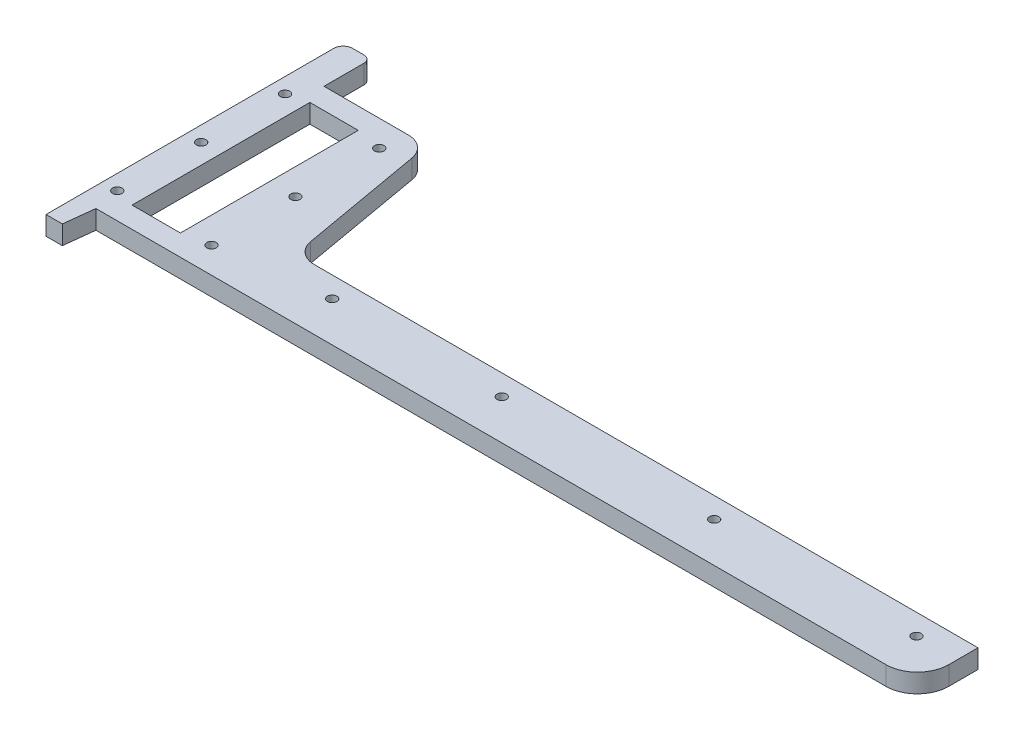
ISO-10303-21;
HEADER;
FILE_DESCRIPTION(('STEP AP214'),'2;1');
FILE_NAME('part.step','',(''),(''),'','','');
FILE_SCHEMA(('AUTOMOTIVE_DESIGN { 1 0 10303 214 1 1 1 1 }'));
ENDSEC;
DATA;
#1=APPLICATION_CONTEXT('core data for automotive mechanical design processes');
#2=APPLICATION_PROTOCOL_DEFINITION('international standard','automotive_design',2000,#1);
#3=PRODUCT_CONTEXT('',#1,'mechanical');
#4=PRODUCT('Part','Part','',(#3));
#5=PRODUCT_RELATED_PRODUCT_CATEGORY('part','',(#4));
#6=PRODUCT_DEFINITION_FORMATION('','',#4);
#7=PRODUCT_DEFINITION_CONTEXT('part definition',#1,'design');
#8=PRODUCT_DEFINITION('design','',#6,#7);
#9=PRODUCT_DEFINITION_SHAPE('','',#8);
#10=(LENGTH_UNIT() NAMED_UNIT(*) SI_UNIT(.MILLI.,.METRE.));
#11=(NAMED_UNIT(*) PLANE_ANGLE_UNIT() SI_UNIT($,.RADIAN.));
#12=(NAMED_UNIT(*) SI_UNIT($,.STERADIAN.) SOLID_ANGLE_UNIT());
#13=UNCERTAINTY_MEASURE_WITH_UNIT(LENGTH_MEASURE(1.E-05),#10,'distance_accuracy_value','');
#14=(GEOMETRIC_REPRESENTATION_CONTEXT(3) GLOBAL_UNCERTAINTY_ASSIGNED_CONTEXT((#13)) GLOBAL_UNIT_ASSIGNED_CONTEXT((#10,
#11,#12)) REPRESENTATION_CONTEXT('',''));
#15=CARTESIAN_POINT('',(0.,0.,0.));
#16=DIRECTION('',(0.,0.,1.));
#17=DIRECTION('',(1.,0.,0.));
#18=AXIS2_PLACEMENT_3D('',#15,#16,#17);
#19=CARTESIAN_POINT('',(0.,3.,0.));
#20=DIRECTION('',(0.,1.,0.));
#21=DIRECTION('',(0.,0.,1.));
#22=AXIS2_PLACEMENT_3D('',#19,#20,#21);
#23=PLANE('',#22);
#24=DIRECTION('',(1.,0.,0.));
#25=VECTOR('',#24,1.);
#26=CARTESIAN_POINT('',(-7.7,3.,12.6));
#27=LINE('',#26,#25);
#28=CARTESIAN_POINT('',(7.7,3.,12.6));
#29=VERTEX_POINT('',#28);
#30=CARTESIAN_POINT('',(-7.7,3.,12.6));
#31=VERTEX_POINT('',#30);
#32=EDGE_CURVE('E472',#29,#31,#27,.F.);
#33=ORIENTED_EDGE('',*,*,#32,.T.);
#34=DIRECTION('',(0.,0.,1.));
#35=VECTOR('',#34,1.);
#36=CARTESIAN_POINT('',(-7.7,3.,-44.));
#37=LINE('',#36,#35);
#38=CARTESIAN_POINT('',(-7.7,3.,-44.));
#39=VERTEX_POINT('',#38);
#40=EDGE_CURVE('E340',#31,#39,#37,.F.);
#41=ORIENTED_EDGE('',*,*,#40,.T.);
#42=DIRECTION('',(-1.,0.,0.));
#43=VECTOR('',#42,1.);
#44=CARTESIAN_POINT('',(7.7,3.,-44.));
#45=LINE('',#44,#43);
#46=CARTESIAN_POINT('',(7.7,3.,-44.));
#47=VERTEX_POINT('',#46);
#48=EDGE_CURVE('E485',#39,#47,#45,.F.);
#49=ORIENTED_EDGE('',*,*,#48,.T.);
#50=DIRECTION('',(0.,0.,-1.));
#51=VECTOR('',#50,1.);
#52=CARTESIAN_POINT('',(7.7,3.,12.6));
#53=LINE('',#52,#51);
#54=EDGE_CURVE('E478',#47,#29,#53,.F.);
#55=ORIENTED_EDGE('',*,*,#54,.T.);
#56=EDGE_LOOP('',(#33,#41,#49,#55));
#57=FACE_BOUND('',#56,.T.);
#58=CARTESIAN_POINT('',(-14.,3.,11.));
#59=DIRECTION('',(0.,1.,0.));
#60=DIRECTION('',(0.,0.,1.));
#61=AXIS2_PLACEMENT_3D('',#58,#59,#60);
#62=CIRCLE('',#61,1.5);
#63=CARTESIAN_POINT('',(-14.,3.,12.5));
#64=VERTEX_POINT('',#63);
#65=EDGE_CURVE('E336',#64,#64,#62,.F.);
#66=ORIENTED_EDGE('',*,*,#65,.T.);
#67=EDGE_LOOP('',(#66));
#68=FACE_BOUND('',#67,.T.);
#69=CARTESIAN_POINT('',(-14.,3.,-15.7));
#70=DIRECTION('',(0.,1.,0.));
#71=DIRECTION('',(0.,0.,1.));
#72=AXIS2_PLACEMENT_3D('',#69,#70,#71);
#73=CIRCLE('',#72,1.5);
#74=CARTESIAN_POINT('',(-14.,3.,-14.2));
#75=VERTEX_POINT('',#74);
#76=EDGE_CURVE('E341',#75,#75,#73,.F.);
#77=ORIENTED_EDGE('',*,*,#76,.T.);
#78=EDGE_LOOP('',(#77));
#79=FACE_BOUND('',#78,.T.);
#80=CARTESIAN_POINT('',(-14.,3.,-42.4));
#81=DIRECTION('',(0.,1.,0.));
#82=DIRECTION('',(0.,0.,1.));
#83=AXIS2_PLACEMENT_3D('',#80,#81,#82);
#84=CIRCLE('',#83,1.5);
#85=CARTESIAN_POINT('',(-14.,3.,-40.9));
#86=VERTEX_POINT('',#85);
#87=EDGE_CURVE('E345',#86,#86,#84,.F.);
#88=ORIENTED_EDGE('',*,*,#87,.T.);
#89=EDGE_LOOP('',(#88));
#90=FACE_BOUND('',#89,.T.);
#91=CARTESIAN_POINT('',(16.,3.,11.));
#92=DIRECTION('',(0.,1.,0.));
#93=DIRECTION('',(0.,0.,1.));
#94=AXIS2_PLACEMENT_3D('',#91,#92,#93);
#95=CIRCLE('',#94,1.5);
#96=CARTESIAN_POINT('',(16.,3.,12.5));
#97=VERTEX_POINT('',#96);
#98=EDGE_CURVE('E349',#97,#97,#95,.F.);
#99=ORIENTED_EDGE('',*,*,#98,.T.);
#100=EDGE_LOOP('',(#99));
#101=FACE_BOUND('',#100,.T.);
#102=CARTESIAN_POINT('',(16.,3.,-15.7));
#103=DIRECTION('',(0.,1.,0.));
#104=DIRECTION('',(0.,0.,1.));
#105=AXIS2_PLACEMENT_3D('',#102,#103,#104);
#106=CIRCLE('',#105,1.5);
#107=CARTESIAN_POINT('',(16.,3.,-14.2));
#108=VERTEX_POINT('',#107);
#109=EDGE_CURVE('E353',#108,#108,#106,.F.);
#110=ORIENTED_EDGE('',*,*,#109,.T.);
#111=EDGE_LOOP('',(#110));
#112=FACE_BOUND('',#111,.T.);
#113=CARTESIAN_POINT('',(16.,3.,-42.4));
#114=DIRECTION('',(0.,1.,0.));
#115=DIRECTION('',(0.,0.,1.));
#116=AXIS2_PLACEMENT_3D('',#113,#114,#115);
#117=CIRCLE('',#116,1.5);
#118=CARTESIAN_POINT('',(16.,3.,-40.9));
#119=VERTEX_POINT('',#118);
#120=EDGE_CURVE('E357',#119,#119,#117,.F.);
#121=ORIENTED_EDGE('',*,*,#120,.T.);
#122=EDGE_LOOP('',(#121));
#123=FACE_BOUND('',#122,.T.);
#124=CARTESIAN_POINT('',(50.,3.,6.6));
#125=DIRECTION('',(0.,1.,0.));
#126=DIRECTION('',(0.,0.,1.));
#127=AXIS2_PLACEMENT_3D('',#124,#125,#126);
#128=CIRCLE('',#127,1.5);
#129=CARTESIAN_POINT('',(50.,3.,8.1));
#130=VERTEX_POINT('',#129);
#131=EDGE_CURVE('E361',#130,#130,#128,.F.);
#132=ORIENTED_EDGE('',*,*,#131,.T.);
#133=EDGE_LOOP('',(#132));
#134=FACE_BOUND('',#133,.T.);
#135=CARTESIAN_POINT('',(104.,3.,6.6));
#136=DIRECTION('',(0.,1.,0.));
#137=DIRECTION('',(0.,0.,1.));
#138=AXIS2_PLACEMENT_3D('',#135,#136,#137);
#139=CIRCLE('',#138,1.5);
#140=CARTESIAN_POINT('',(104.,3.,8.1));
#141=VERTEX_POINT('',#140);
#142=EDGE_CURVE('E365',#141,#141,#139,.F.);
#143=ORIENTED_EDGE('',*,*,#142,.T.);
#144=EDGE_LOOP('',(#143));
#145=FACE_BOUND('',#144,.T.);
#146=CARTESIAN_POINT('',(171.6,3.,6.6));
#147=DIRECTION('',(0.,1.,0.));
#148=DIRECTION('',(0.,0.,1.));
#149=AXIS2_PLACEMENT_3D('',#146,#147,#148);
#150=CIRCLE('',#149,1.5);
#151=CARTESIAN_POINT('',(171.6,3.,8.1));
#152=VERTEX_POINT('',#151);
#153=EDGE_CURVE('E369',#152,#152,#150,.F.);
#154=ORIENTED_EDGE('',*,*,#153,.T.);
#155=EDGE_LOOP('',(#154));
#156=FACE_BOUND('',#155,.T.);
#157=CARTESIAN_POINT('',(236.,3.,6.6));
#158=DIRECTION('',(0.,1.,0.));
#159=DIRECTION('',(0.,0.,1.));
#160=AXIS2_PLACEMENT_3D('',#157,#158,#159);
#161=CIRCLE('',#160,1.5);
#162=CARTESIAN_POINT('',(236.,3.,8.1));
#163=VERTEX_POINT('',#162);
#164=EDGE_CURVE('E215',#163,#163,#161,.F.);
#165=ORIENTED_EDGE('',*,*,#164,.T.);
#166=EDGE_LOOP('',(#165));
#167=FACE_BOUND('',#166,.T.);
#168=DIRECTION('',(-1.,0.,0.));
#169=VECTOR('',#168,1.);
#170=CARTESIAN_POINT('',(249.,3.,0.));
#171=LINE('',#170,#169);
#172=CARTESIAN_POINT('',(37.67369741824,3.,0.));
#173=VERTEX_POINT('',#172);
#174=CARTESIAN_POINT('',(249.,3.,0.));
#175=VERTEX_POINT('',#174);
#176=EDGE_CURVE('E199',#173,#175,#171,.F.);
#177=ORIENTED_EDGE('',*,*,#176,.F.);
#178=CARTESIAN_POINT('',(37.67369741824,3.,-7.));
#179=DIRECTION('',(0.,1.,0.));
#180=DIRECTION('',(0.,0.,1.));
#181=AXIS2_PLACEMENT_3D('',#178,#179,#180);
#182=CIRCLE('',#181,7.);
#183=CARTESIAN_POINT('',(30.7800431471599,3.,-5.7844627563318));
#184=VERTEX_POINT('',#183);
#185=EDGE_CURVE('E20',#173,#184,#182,.F.);
#186=ORIENTED_EDGE('',*,*,#185,.T.);
#187=DIRECTION('',(-0.173648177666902,0.,-0.984807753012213));
#188=VECTOR('',#187,1.);
#189=CARTESIAN_POINT('',(30.78004314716,3.,-5.784462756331));
#190=LINE('',#189,#188);
#191=CARTESIAN_POINT('',(23.880178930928,3.,-44.9155372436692));
#192=VERTEX_POINT('',#191);
#193=EDGE_CURVE('E196',#192,#184,#190,.F.);
#194=ORIENTED_EDGE('',*,*,#193,.F.);
#195=CARTESIAN_POINT('',(16.98652465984,3.,-43.7));
#196=DIRECTION('',(0.,1.,0.));
#197=DIRECTION('',(0.,0.,1.));
#198=AXIS2_PLACEMENT_3D('',#195,#196,#197);
#199=CIRCLE('',#198,7.);
#200=CARTESIAN_POINT('',(16.98652465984,3.,-50.7));
#201=VERTEX_POINT('',#200);
#202=EDGE_CURVE('E385',#201,#192,#199,.F.);
#203=ORIENTED_EDGE('',*,*,#202,.F.);
#204=DIRECTION('',(-1.,0.,0.));
#205=VECTOR('',#204,1.);
#206=CARTESIAN_POINT('',(16.98652465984,3.,-50.7));
#207=LINE('',#206,#205);
#208=CARTESIAN_POINT('',(-9.9,3.,-50.7));
#209=VERTEX_POINT('',#208);
#210=EDGE_CURVE('E260',#209,#201,#207,.F.);
#211=ORIENTED_EDGE('',*,*,#210,.F.);
#212=DIRECTION('',(0.,0.,-1.));
#213=VECTOR('',#212,1.);
#214=CARTESIAN_POINT('',(-9.9,3.,-50.7));
#215=LINE('',#214,#213);
#216=CARTESIAN_POINT('',(-9.9,3.,-63.4));
#217=VERTEX_POINT('',#216);
#218=EDGE_CURVE('E253',#217,#209,#215,.F.);
#219=ORIENTED_EDGE('',*,*,#218,.F.);
#220=CARTESIAN_POINT('',(-12.2,3.,-63.4));
#221=DIRECTION('',(0.,1.,0.));
#222=DIRECTION('',(0.,0.,1.));
#223=AXIS2_PLACEMENT_3D('',#220,#221,#222);
#224=CIRCLE('',#223,2.3);
#225=CARTESIAN_POINT('',(-12.2,3.,-65.7));
#226=VERTEX_POINT('',#225);
#227=EDGE_CURVE('E383',#226,#217,#224,.F.);
#228=ORIENTED_EDGE('',*,*,#227,.F.);
#229=DIRECTION('',(-1.,0.,0.));
#230=VECTOR('',#229,1.);
#231=CARTESIAN_POINT('',(-12.2,3.,-65.7));
#232=LINE('',#231,#230);
#233=CARTESIAN_POINT('',(-15.8,3.,-65.7));
#234=VERTEX_POINT('',#233);
#235=EDGE_CURVE('E248',#234,#226,#232,.F.);
#236=ORIENTED_EDGE('',*,*,#235,.F.);
#237=CARTESIAN_POINT('',(-15.8,3.,-62.7));
#238=DIRECTION('',(0.,1.,0.));
#239=DIRECTION('',(0.,0.,1.));
#240=AXIS2_PLACEMENT_3D('',#237,#238,#239);
#241=CIRCLE('',#240,3.);
#242=CARTESIAN_POINT('',(-18.8,3.,-62.7));
#243=VERTEX_POINT('',#242);
#244=EDGE_CURVE('E380',#243,#234,#241,.F.);
#245=ORIENTED_EDGE('',*,*,#244,.F.);
#246=DIRECTION('',(0.,0.,1.));
#247=VECTOR('',#246,1.);
#248=CARTESIAN_POINT('',(-18.8,3.,-62.7));
#249=LINE('',#248,#247);
#250=CARTESIAN_POINT('',(-18.8,3.,28.9));
#251=VERTEX_POINT('',#250);
#252=EDGE_CURVE('E242',#251,#243,#249,.F.);
#253=ORIENTED_EDGE('',*,*,#252,.F.);
#254=DIRECTION('',(1.,0.,0.));
#255=VECTOR('',#254,1.);
#256=CARTESIAN_POINT('',(-18.8,3.,28.9));
#257=LINE('',#256,#255);
#258=CARTESIAN_POINT('',(-13.6,3.,28.9));
#259=VERTEX_POINT('',#258);
#260=EDGE_CURVE('E236',#259,#251,#257,.F.);
#261=ORIENTED_EDGE('',*,*,#260,.F.);
#262=DIRECTION('',(0.113203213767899,0.,-0.993571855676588));
#263=VECTOR('',#262,1.);
#264=CARTESIAN_POINT('',(-13.6,3.,28.9));
#265=LINE('',#264,#263);
#266=CARTESIAN_POINT('',(-12.5062181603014,3.,19.2999999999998));
#267=VERTEX_POINT('',#266);
#268=EDGE_CURVE('E230',#267,#259,#265,.F.);
#269=ORIENTED_EDGE('',*,*,#268,.F.);
#270=DIRECTION('',(1.,0.,0.));
#271=VECTOR('',#270,1.);
#272=CARTESIAN_POINT('',(-12.5062181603,3.,19.3));
#273=LINE('',#272,#271);
#274=CARTESIAN_POINT('',(239.,3.,19.3));
#275=VERTEX_POINT('',#274);
#276=EDGE_CURVE('E223',#275,#267,#273,.F.);
#277=ORIENTED_EDGE('',*,*,#276,.F.);
#278=CARTESIAN_POINT('',(239.,3.,9.3));
#279=DIRECTION('',(0.,1.,0.));
#280=DIRECTION('',(0.,0.,1.));
#281=AXIS2_PLACEMENT_3D('',#278,#279,#280);
#282=CIRCLE('',#281,10.);
#283=CARTESIAN_POINT('',(249.,3.,9.3));
#284=VERTEX_POINT('',#283);
#285=EDGE_CURVE('E376',#284,#275,#282,.F.);
#286=ORIENTED_EDGE('',*,*,#285,.F.);
#287=DIRECTION('',(0.,0.,-1.));
#288=VECTOR('',#287,1.);
#289=CARTESIAN_POINT('',(249.,3.,9.3));
#290=LINE('',#289,#288);
#291=EDGE_CURVE('E207',#175,#284,#290,.F.);
#292=ORIENTED_EDGE('',*,*,#291,.F.);
#293=EDGE_LOOP('',(#177,#186,#194,#203,#211,#219,#228,#236,#245,#253,#261,#269,#277,#286,#292));
#294=FACE_BOUND('',#293,.T.);
#295=ADVANCED_FACE('F17',(#57,#68,#79,#90,#101,#112,#123,#134,#145,#156,#167,#294),#23,.T.);
#296=CARTESIAN_POINT('',(37.67369741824,-3.,-7.));
#297=DIRECTION('',(0.,1.,0.));
#298=DIRECTION('',(0.,0.,1.));
#299=AXIS2_PLACEMENT_3D('',#296,#297,#298);
#300=CYLINDRICAL_SURFACE('',#299,7.);
#301=ORIENTED_EDGE('',*,*,#185,.F.);
#302=DIRECTION('',(0.,1.,0.));
#303=VECTOR('',#302,1.);
#304=CARTESIAN_POINT('',(37.67369741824,-3.,0.));
#305=LINE('',#304,#303);
#306=CARTESIAN_POINT('',(37.67369741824,-3.,0.));
#307=VERTEX_POINT('',#306);
#308=EDGE_CURVE('E189',#307,#173,#305,.T.);
#309=ORIENTED_EDGE('',*,*,#308,.F.);
#310=CARTESIAN_POINT('',(37.67369741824,-3.,-7.));
#311=DIRECTION('',(0.,1.,0.));
#312=DIRECTION('',(0.,0.,1.));
#313=AXIS2_PLACEMENT_3D('',#310,#311,#312);
#314=CIRCLE('',#313,7.);
#315=CARTESIAN_POINT('',(30.7800431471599,-3.,-5.78446275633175));
#316=VERTEX_POINT('',#315);
#317=EDGE_CURVE('E333',#307,#316,#314,.F.);
#318=ORIENTED_EDGE('',*,*,#317,.T.);
#319=DIRECTION('',(0.,1.,0.));
#320=VECTOR('',#319,1.);
#321=CARTESIAN_POINT('',(30.78004314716,-3.,-5.784462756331));
#322=LINE('',#321,#320);
#323=EDGE_CURVE('E191',#184,#316,#322,.F.);
#324=ORIENTED_EDGE('',*,*,#323,.F.);
#325=EDGE_LOOP('',(#301,#309,#318,#324));
#326=FACE_BOUND('',#325,.T.);
#327=ADVANCED_FACE('F187',(#326),#300,.F.);
#328=CARTESIAN_POINT('',(30.78004314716,-3.,-5.784462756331));
#329=DIRECTION('',(0.984807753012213,0.,-0.173648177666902));
#330=DIRECTION('',(-0.173648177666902,0.,-0.984807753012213));
#331=AXIS2_PLACEMENT_3D('',#328,#329,#330);
#332=PLANE('',#331);
#333=ORIENTED_EDGE('',*,*,#323,.T.);
#334=DIRECTION('',(-0.173648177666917,0.,-0.98480775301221));
#335=VECTOR('',#334,1.);
#336=CARTESIAN_POINT('',(30.78004314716,-3.,-5.784462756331));
#337=LINE('',#336,#335);
#338=CARTESIAN_POINT('',(23.8801789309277,-3.,-44.9155372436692));
#339=VERTEX_POINT('',#338);
#340=EDGE_CURVE('E332',#316,#339,#337,.T.);
#341=ORIENTED_EDGE('',*,*,#340,.T.);
#342=DIRECTION('',(0.,1.,0.));
#343=VECTOR('',#342,1.);
#344=CARTESIAN_POINT('',(23.8801789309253,-3.,-44.9155372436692));
#345=LINE('',#344,#343);
#346=EDGE_CURVE('E263',#192,#339,#345,.F.);
#347=ORIENTED_EDGE('',*,*,#346,.F.);
#348=ORIENTED_EDGE('',*,*,#193,.T.);
#349=EDGE_LOOP('',(#333,#341,#347,#348));
#350=FACE_BOUND('',#349,.T.);
#351=ADVANCED_FACE('F464',(#350),#332,.T.);
#352=CARTESIAN_POINT('',(16.98652465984,-3.,-43.7));
#353=DIRECTION('',(0.,1.,0.));
#354=DIRECTION('',(0.,0.,1.));
#355=AXIS2_PLACEMENT_3D('',#352,#353,#354);
#356=CYLINDRICAL_SURFACE('',#355,7.);
#357=ORIENTED_EDGE('',*,*,#346,.T.);
#358=CARTESIAN_POINT('',(16.98652465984,-3.,-43.7));
#359=DIRECTION('',(0.,1.,0.));
#360=DIRECTION('',(0.,0.,1.));
#361=AXIS2_PLACEMENT_3D('',#358,#359,#360);
#362=CIRCLE('',#361,7.);
#363=CARTESIAN_POINT('',(16.98652465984,-3.,-50.7));
#364=VERTEX_POINT('',#363);
#365=EDGE_CURVE('E327',#339,#364,#362,.T.);
#366=ORIENTED_EDGE('',*,*,#365,.T.);
#367=DIRECTION('',(0.,1.,0.));
#368=VECTOR('',#367,1.);
#369=CARTESIAN_POINT('',(16.98652465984,-3.,-50.7));
#370=LINE('',#369,#368);
#371=EDGE_CURVE('E257',#201,#364,#370,.F.);
#372=ORIENTED_EDGE('',*,*,#371,.F.);
#373=ORIENTED_EDGE('',*,*,#202,.T.);
#374=EDGE_LOOP('',(#357,#366,#372,#373));
#375=FACE_BOUND('',#374,.T.);
#376=ADVANCED_FACE('F462',(#375),#356,.T.);
#377=CARTESIAN_POINT('',(16.98652465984,-3.,-50.7));
#378=DIRECTION('',(0.,0.,-1.));
#379=DIRECTION('',(-1.,0.,0.));
#380=AXIS2_PLACEMENT_3D('',#377,#378,#379);
#381=PLANE('',#380);
#382=ORIENTED_EDGE('',*,*,#371,.T.);
#383=DIRECTION('',(1.,0.,0.));
#384=VECTOR('',#383,1.);
#385=CARTESIAN_POINT('',(0.,-3.,-50.7));
#386=LINE('',#385,#384);
#387=CARTESIAN_POINT('',(-9.9,-3.,-50.7));
#388=VERTEX_POINT('',#387);
#389=EDGE_CURVE('E331',#364,#388,#386,.F.);
#390=ORIENTED_EDGE('',*,*,#389,.T.);
#391=DIRECTION('',(0.,1.,0.));
#392=VECTOR('',#391,1.);
#393=CARTESIAN_POINT('',(-9.9,-3.,-50.7));
#394=LINE('',#393,#392);
#395=EDGE_CURVE('E256',#209,#388,#394,.F.);
#396=ORIENTED_EDGE('',*,*,#395,.F.);
#397=ORIENTED_EDGE('',*,*,#210,.T.);
#398=EDGE_LOOP('',(#382,#390,#396,#397));
#399=FACE_BOUND('',#398,.T.);
#400=ADVANCED_FACE('F450',(#399),#381,.T.);
#401=CARTESIAN_POINT('',(-9.9,-3.,-50.7));
#402=DIRECTION('',(1.,0.,0.));
#403=DIRECTION('',(0.,0.,-1.));
#404=AXIS2_PLACEMENT_3D('',#401,#402,#403);
#405=PLANE('',#404);
#406=ORIENTED_EDGE('',*,*,#395,.T.);
#407=DIRECTION('',(0.,0.,1.));
#408=VECTOR('',#407,1.);
#409=CARTESIAN_POINT('',(-9.9,-3.,0.));
#410=LINE('',#409,#408);
#411=CARTESIAN_POINT('',(-9.9,-3.,-63.4));
#412=VERTEX_POINT('',#411);
#413=EDGE_CURVE('E326',#388,#412,#410,.F.);
#414=ORIENTED_EDGE('',*,*,#413,.T.);
#415=DIRECTION('',(0.,1.,0.));
#416=VECTOR('',#415,1.);
#417=CARTESIAN_POINT('',(-9.9,-3.,-63.4));
#418=LINE('',#417,#416);
#419=EDGE_CURVE('E252',#217,#412,#418,.F.);
#420=ORIENTED_EDGE('',*,*,#419,.F.);
#421=ORIENTED_EDGE('',*,*,#218,.T.);
#422=EDGE_LOOP('',(#406,#414,#420,#421));
#423=FACE_BOUND('',#422,.T.);
#424=ADVANCED_FACE('F540',(#423),#405,.T.);
#425=CARTESIAN_POINT('',(-12.2,-3.,-63.4));
#426=DIRECTION('',(0.,1.,0.));
#427=DIRECTION('',(0.,0.,1.));
#428=AXIS2_PLACEMENT_3D('',#425,#426,#427);
#429=CYLINDRICAL_SURFACE('',#428,2.3);
#430=ORIENTED_EDGE('',*,*,#419,.T.);
#431=CARTESIAN_POINT('',(-12.2,-3.,-63.4));
#432=DIRECTION('',(0.,1.,0.));
#433=DIRECTION('',(0.,0.,1.));
#434=AXIS2_PLACEMENT_3D('',#431,#432,#433);
#435=CIRCLE('',#434,2.3);
#436=CARTESIAN_POINT('',(-12.2,-3.,-65.7));
#437=VERTEX_POINT('',#436);
#438=EDGE_CURVE('E322',#412,#437,#435,.T.);
#439=ORIENTED_EDGE('',*,*,#438,.T.);
#440=DIRECTION('',(0.,1.,0.));
#441=VECTOR('',#440,1.);
#442=CARTESIAN_POINT('',(-12.2,-3.,-65.7));
#443=LINE('',#442,#441);
#444=EDGE_CURVE('E251',#226,#437,#443,.F.);
#445=ORIENTED_EDGE('',*,*,#444,.F.);
#446=ORIENTED_EDGE('',*,*,#227,.T.);
#447=EDGE_LOOP('',(#430,#439,#445,#446));
#448=FACE_BOUND('',#447,.T.);
#449=ADVANCED_FACE('F548',(#448),#429,.T.);
#450=CARTESIAN_POINT('',(-12.2,-3.,-65.7));
#451=DIRECTION('',(0.,0.,-1.));
#452=DIRECTION('',(-1.,0.,0.));
#453=AXIS2_PLACEMENT_3D('',#450,#451,#452);
#454=PLANE('',#453);
#455=ORIENTED_EDGE('',*,*,#444,.T.);
#456=DIRECTION('',(1.,0.,0.));
#457=VECTOR('',#456,1.);
#458=CARTESIAN_POINT('',(0.,-3.,-65.7));
#459=LINE('',#458,#457);
#460=CARTESIAN_POINT('',(-15.8,-3.,-65.7));
#461=VERTEX_POINT('',#460);
#462=EDGE_CURVE('E321',#437,#461,#459,.F.);
#463=ORIENTED_EDGE('',*,*,#462,.T.);
#464=DIRECTION('',(0.,1.,0.));
#465=VECTOR('',#464,1.);
#466=CARTESIAN_POINT('',(-15.8,-3.,-65.7));
#467=LINE('',#466,#465);
#468=EDGE_CURVE('E245',#234,#461,#467,.F.);
#469=ORIENTED_EDGE('',*,*,#468,.F.);
#470=ORIENTED_EDGE('',*,*,#235,.T.);
#471=EDGE_LOOP('',(#455,#463,#469,#470));
#472=FACE_BOUND('',#471,.T.);
#473=ADVANCED_FACE('F551',(#472),#454,.T.);
#474=CARTESIAN_POINT('',(-15.8,-3.,-62.7));
#475=DIRECTION('',(0.,1.,0.));
#476=DIRECTION('',(0.,0.,1.));
#477=AXIS2_PLACEMENT_3D('',#474,#475,#476);
#478=CYLINDRICAL_SURFACE('',#477,3.);
#479=ORIENTED_EDGE('',*,*,#468,.T.);
#480=CARTESIAN_POINT('',(-15.8,-3.,-62.7));
#481=DIRECTION('',(0.,1.,0.));
#482=DIRECTION('',(0.,0.,1.));
#483=AXIS2_PLACEMENT_3D('',#480,#481,#482);
#484=CIRCLE('',#483,3.);
#485=CARTESIAN_POINT('',(-18.8,-3.,-62.7));
#486=VERTEX_POINT('',#485);
#487=EDGE_CURVE('E316',#461,#486,#484,.T.);
#488=ORIENTED_EDGE('',*,*,#487,.T.);
#489=DIRECTION('',(0.,1.,0.));
#490=VECTOR('',#489,1.);
#491=CARTESIAN_POINT('',(-18.8,-3.,-62.7));
#492=LINE('',#491,#490);
#493=EDGE_CURVE('E239',#243,#486,#492,.F.);
#494=ORIENTED_EDGE('',*,*,#493,.F.);
#495=ORIENTED_EDGE('',*,*,#244,.T.);
#496=EDGE_LOOP('',(#479,#488,#494,#495));
#497=FACE_BOUND('',#496,.T.);
#498=ADVANCED_FACE('F557',(#497),#478,.T.);
#499=CARTESIAN_POINT('',(-18.8,-3.,-62.7));
#500=DIRECTION('',(-1.,0.,0.));
#501=DIRECTION('',(0.,0.,1.));
#502=AXIS2_PLACEMENT_3D('',#499,#500,#501);
#503=PLANE('',#502);
#504=ORIENTED_EDGE('',*,*,#493,.T.);
#505=DIRECTION('',(0.,0.,1.));
#506=VECTOR('',#505,1.);
#507=CARTESIAN_POINT('',(-18.8,-3.,0.));
#508=LINE('',#507,#506);
#509=CARTESIAN_POINT('',(-18.8,-3.,28.9));
#510=VERTEX_POINT('',#509);
#511=EDGE_CURVE('E320',#486,#510,#508,.T.);
#512=ORIENTED_EDGE('',*,*,#511,.T.);
#513=DIRECTION('',(0.,1.,0.));
#514=VECTOR('',#513,1.);
#515=CARTESIAN_POINT('',(-18.8,-3.,28.9));
#516=LINE('',#515,#514);
#517=EDGE_CURVE('E233',#251,#510,#516,.F.);
#518=ORIENTED_EDGE('',*,*,#517,.F.);
#519=ORIENTED_EDGE('',*,*,#252,.T.);
#520=EDGE_LOOP('',(#504,#512,#518,#519));
#521=FACE_BOUND('',#520,.T.);
#522=ADVANCED_FACE('F564',(#521),#503,.T.);
#523=CARTESIAN_POINT('',(-18.8,-3.,28.9));
#524=DIRECTION('',(0.,0.,1.));
#525=DIRECTION('',(1.,0.,0.));
#526=AXIS2_PLACEMENT_3D('',#523,#524,#525);
#527=PLANE('',#526);
#528=ORIENTED_EDGE('',*,*,#517,.T.);
#529=DIRECTION('',(1.,0.,0.));
#530=VECTOR('',#529,1.);
#531=CARTESIAN_POINT('',(0.,-3.,28.9));
#532=LINE('',#531,#530);
#533=CARTESIAN_POINT('',(-13.6,-3.,28.9));
#534=VERTEX_POINT('',#533);
#535=EDGE_CURVE('E420',#510,#534,#532,.T.);
#536=ORIENTED_EDGE('',*,*,#535,.T.);
#537=DIRECTION('',(0.,1.,0.));
#538=VECTOR('',#537,1.);
#539=CARTESIAN_POINT('',(-13.6,-3.,28.9));
#540=LINE('',#539,#538);
#541=EDGE_CURVE('E227',#259,#534,#540,.F.);
#542=ORIENTED_EDGE('',*,*,#541,.F.);
#543=ORIENTED_EDGE('',*,*,#260,.T.);
#544=EDGE_LOOP('',(#528,#536,#542,#543));
#545=FACE_BOUND('',#544,.T.);
#546=ADVANCED_FACE('F566',(#545),#527,.T.);
#547=CARTESIAN_POINT('',(-13.6,-3.,28.9));
#548=DIRECTION('',(0.993571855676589,0.,0.113203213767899));
#549=DIRECTION('',(0.113203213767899,0.,-0.993571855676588));
#550=AXIS2_PLACEMENT_3D('',#547,#548,#549);
#551=PLANE('',#550);
#552=ORIENTED_EDGE('',*,*,#541,.T.);
#553=DIRECTION('',(0.113203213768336,0.,-0.993571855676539));
#554=VECTOR('',#553,1.);
#555=CARTESIAN_POINT('',(-13.6,-3.,28.9));
#556=LINE('',#555,#554);
#557=CARTESIAN_POINT('',(-12.5062181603,-3.,19.3));
#558=VERTEX_POINT('',#557);
#559=EDGE_CURVE('E416',#534,#558,#556,.T.);
#560=ORIENTED_EDGE('',*,*,#559,.T.);
#561=DIRECTION('',(0.,1.,0.));
#562=VECTOR('',#561,1.);
#563=CARTESIAN_POINT('',(-12.5062181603,-3.,19.3));
#564=LINE('',#563,#562);
#565=EDGE_CURVE('E226',#267,#558,#564,.F.);
#566=ORIENTED_EDGE('',*,*,#565,.F.);
#567=ORIENTED_EDGE('',*,*,#268,.T.);
#568=EDGE_LOOP('',(#552,#560,#566,#567));
#569=FACE_BOUND('',#568,.T.);
#570=ADVANCED_FACE('F571',(#569),#551,.T.);
#571=CARTESIAN_POINT('',(-12.5062181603,-3.,19.3));
#572=DIRECTION('',(0.,0.,1.));
#573=DIRECTION('',(1.,0.,0.));
#574=AXIS2_PLACEMENT_3D('',#571,#572,#573);
#575=PLANE('',#574);
#576=ORIENTED_EDGE('',*,*,#565,.T.);
#577=DIRECTION('',(1.,0.,0.));
#578=VECTOR('',#577,1.);
#579=CARTESIAN_POINT('',(0.,-3.,19.3));
#580=LINE('',#579,#578);
#581=CARTESIAN_POINT('',(239.,-3.,19.3));
#582=VERTEX_POINT('',#581);
#583=EDGE_CURVE('E315',#558,#582,#580,.T.);
#584=ORIENTED_EDGE('',*,*,#583,.T.);
#585=DIRECTION('',(0.,1.,0.));
#586=VECTOR('',#585,1.);
#587=CARTESIAN_POINT('',(239.,-3.,19.3));
#588=LINE('',#587,#586);
#589=EDGE_CURVE('E379',#275,#582,#588,.F.);
#590=ORIENTED_EDGE('',*,*,#589,.F.);
#591=ORIENTED_EDGE('',*,*,#276,.T.);
#592=EDGE_LOOP('',(#576,#584,#590,#591));
#593=FACE_BOUND('',#592,.T.);
#594=ADVANCED_FACE('F575',(#593),#575,.T.);
#595=CARTESIAN_POINT('',(239.,-3.,9.3));
#596=DIRECTION('',(0.,1.,0.));
#597=DIRECTION('',(0.,0.,1.));
#598=AXIS2_PLACEMENT_3D('',#595,#596,#597);
#599=CYLINDRICAL_SURFACE('',#598,10.);
#600=ORIENTED_EDGE('',*,*,#589,.T.);
#601=CARTESIAN_POINT('',(239.,-3.,9.3));
#602=DIRECTION('',(0.,1.,0.));
#603=DIRECTION('',(0.,0.,1.));
#604=AXIS2_PLACEMENT_3D('',#601,#602,#603);
#605=CIRCLE('',#604,10.);
#606=CARTESIAN_POINT('',(249.,-3.,9.3));
#607=VERTEX_POINT('',#606);
#608=EDGE_CURVE('E310',#582,#607,#605,.T.);
#609=ORIENTED_EDGE('',*,*,#608,.T.);
#610=DIRECTION('',(0.,1.,0.));
#611=VECTOR('',#610,1.);
#612=CARTESIAN_POINT('',(249.,-3.,9.3));
#613=LINE('',#612,#611);
#614=EDGE_CURVE('E204',#284,#607,#613,.F.);
#615=ORIENTED_EDGE('',*,*,#614,.F.);
#616=ORIENTED_EDGE('',*,*,#285,.T.);
#617=EDGE_LOOP('',(#600,#609,#615,#616));
#618=FACE_BOUND('',#617,.T.);
#619=ADVANCED_FACE('F577',(#618),#599,.T.);
#620=CARTESIAN_POINT('',(249.,-3.,9.3));
#621=DIRECTION('',(1.,0.,0.));
#622=DIRECTION('',(0.,0.,-1.));
#623=AXIS2_PLACEMENT_3D('',#620,#621,#622);
#624=PLANE('',#623);
#625=ORIENTED_EDGE('',*,*,#614,.T.);
#626=DIRECTION('',(0.,0.,1.));
#627=VECTOR('',#626,1.);
#628=CARTESIAN_POINT('',(249.,-3.,0.));
#629=LINE('',#628,#627);
#630=CARTESIAN_POINT('',(249.,-3.,0.));
#631=VERTEX_POINT('',#630);
#632=EDGE_CURVE('E314',#607,#631,#629,.F.);
#633=ORIENTED_EDGE('',*,*,#632,.T.);
#634=DIRECTION('',(0.,1.,0.));
#635=VECTOR('',#634,1.);
#636=CARTESIAN_POINT('',(249.,-3.,0.));
#637=LINE('',#636,#635);
#638=EDGE_CURVE('E210',#175,#631,#637,.F.);
#639=ORIENTED_EDGE('',*,*,#638,.F.);
#640=ORIENTED_EDGE('',*,*,#291,.T.);
#641=EDGE_LOOP('',(#625,#633,#639,#640));
#642=FACE_BOUND('',#641,.T.);
#643=ADVANCED_FACE('F584',(#642),#624,.T.);
#644=CARTESIAN_POINT('',(249.,-3.,0.));
#645=DIRECTION('',(0.,0.,-1.));
#646=DIRECTION('',(-1.,0.,0.));
#647=AXIS2_PLACEMENT_3D('',#644,#645,#646);
#648=PLANE('',#647);
#649=ORIENTED_EDGE('',*,*,#638,.T.);
#650=DIRECTION('',(1.,0.,0.));
#651=VECTOR('',#650,1.);
#652=CARTESIAN_POINT('',(0.,-3.,0.));
#653=LINE('',#652,#651);
#654=EDGE_CURVE('E202',#631,#307,#653,.F.);
#655=ORIENTED_EDGE('',*,*,#654,.T.);
#656=ORIENTED_EDGE('',*,*,#308,.T.);
#657=ORIENTED_EDGE('',*,*,#176,.T.);
#658=EDGE_LOOP('',(#649,#655,#656,#657));
#659=FACE_BOUND('',#658,.T.);
#660=ADVANCED_FACE('F198',(#659),#648,.T.);
#661=CARTESIAN_POINT('',(236.,-3.,6.6));
#662=DIRECTION('',(0.,1.,0.));
#663=DIRECTION('',(0.,0.,1.));
#664=AXIS2_PLACEMENT_3D('',#661,#662,#663);
#665=CYLINDRICAL_SURFACE('',#664,1.5);
#666=ORIENTED_EDGE('',*,*,#164,.F.);
#667=EDGE_LOOP('',(#666));
#668=FACE_BOUND('',#667,.T.);
#669=CARTESIAN_POINT('',(236.,-3.,6.6));
#670=DIRECTION('',(0.,1.,0.));
#671=DIRECTION('',(0.,0.,1.));
#672=AXIS2_PLACEMENT_3D('',#669,#670,#671);
#673=CIRCLE('',#672,1.5);
#674=CARTESIAN_POINT('',(236.,-3.,8.1));
#675=VERTEX_POINT('',#674);
#676=EDGE_CURVE('E306',#675,#675,#673,.F.);
#677=ORIENTED_EDGE('',*,*,#676,.T.);
#678=EDGE_LOOP('',(#677));
#679=FACE_BOUND('',#678,.T.);
#680=ADVANCED_FACE('F640',(#668,#679),#665,.F.);
#681=CARTESIAN_POINT('',(171.6,-3.,6.6));
#682=DIRECTION('',(0.,1.,0.));
#683=DIRECTION('',(0.,0.,1.));
#684=AXIS2_PLACEMENT_3D('',#681,#682,#683);
#685=CYLINDRICAL_SURFACE('',#684,1.5);
#686=ORIENTED_EDGE('',*,*,#153,.F.);
#687=EDGE_LOOP('',(#686));
#688=FACE_BOUND('',#687,.T.);
#689=CARTESIAN_POINT('',(171.6,-3.,6.6));
#690=DIRECTION('',(0.,1.,0.));
#691=DIRECTION('',(0.,0.,1.));
#692=AXIS2_PLACEMENT_3D('',#689,#690,#691);
#693=CIRCLE('',#692,1.5);
#694=CARTESIAN_POINT('',(171.6,-3.,8.1));
#695=VERTEX_POINT('',#694);
#696=EDGE_CURVE('E302',#695,#695,#693,.F.);
#697=ORIENTED_EDGE('',*,*,#696,.T.);
#698=EDGE_LOOP('',(#697));
#699=FACE_BOUND('',#698,.T.);
#700=ADVANCED_FACE('F636',(#688,#699),#685,.F.);
#701=CARTESIAN_POINT('',(104.,-3.,6.6));
#702=DIRECTION('',(0.,1.,0.));
#703=DIRECTION('',(0.,0.,1.));
#704=AXIS2_PLACEMENT_3D('',#701,#702,#703);
#705=CYLINDRICAL_SURFACE('',#704,1.5);
#706=ORIENTED_EDGE('',*,*,#142,.F.);
#707=EDGE_LOOP('',(#706));
#708=FACE_BOUND('',#707,.T.);
#709=CARTESIAN_POINT('',(104.,-3.,6.6));
#710=DIRECTION('',(0.,1.,0.));
#711=DIRECTION('',(0.,0.,1.));
#712=AXIS2_PLACEMENT_3D('',#709,#710,#711);
#713=CIRCLE('',#712,1.5);
#714=CARTESIAN_POINT('',(104.,-3.,8.1));
#715=VERTEX_POINT('',#714);
#716=EDGE_CURVE('E298',#715,#715,#713,.F.);
#717=ORIENTED_EDGE('',*,*,#716,.T.);
#718=EDGE_LOOP('',(#717));
#719=FACE_BOUND('',#718,.T.);
#720=ADVANCED_FACE('F632',(#708,#719),#705,.F.);
#721=CARTESIAN_POINT('',(50.,-3.,6.6));
#722=DIRECTION('',(0.,1.,0.));
#723=DIRECTION('',(0.,0.,1.));
#724=AXIS2_PLACEMENT_3D('',#721,#722,#723);
#725=CYLINDRICAL_SURFACE('',#724,1.5);
#726=ORIENTED_EDGE('',*,*,#131,.F.);
#727=EDGE_LOOP('',(#726));
#728=FACE_BOUND('',#727,.T.);
#729=CARTESIAN_POINT('',(50.,-3.,6.6));
#730=DIRECTION('',(0.,1.,0.));
#731=DIRECTION('',(0.,0.,1.));
#732=AXIS2_PLACEMENT_3D('',#729,#730,#731);
#733=CIRCLE('',#732,1.5);
#734=CARTESIAN_POINT('',(50.,-3.,8.1));
#735=VERTEX_POINT('',#734);
#736=EDGE_CURVE('E294',#735,#735,#733,.F.);
#737=ORIENTED_EDGE('',*,*,#736,.T.);
#738=EDGE_LOOP('',(#737));
#739=FACE_BOUND('',#738,.T.);
#740=ADVANCED_FACE('F628',(#728,#739),#725,.F.);
#741=CARTESIAN_POINT('',(16.,-3.,-42.4));
#742=DIRECTION('',(0.,1.,0.));
#743=DIRECTION('',(0.,0.,1.));
#744=AXIS2_PLACEMENT_3D('',#741,#742,#743);
#745=CYLINDRICAL_SURFACE('',#744,1.5);
#746=ORIENTED_EDGE('',*,*,#120,.F.);
#747=EDGE_LOOP('',(#746));
#748=FACE_BOUND('',#747,.T.);
#749=CARTESIAN_POINT('',(16.,-3.,-42.4));
#750=DIRECTION('',(0.,1.,0.));
#751=DIRECTION('',(0.,0.,1.));
#752=AXIS2_PLACEMENT_3D('',#749,#750,#751);
#753=CIRCLE('',#752,1.5);
#754=CARTESIAN_POINT('',(16.,-3.,-40.9));
#755=VERTEX_POINT('',#754);
#756=EDGE_CURVE('E290',#755,#755,#753,.F.);
#757=ORIENTED_EDGE('',*,*,#756,.T.);
#758=EDGE_LOOP('',(#757));
#759=FACE_BOUND('',#758,.T.);
#760=ADVANCED_FACE('F624',(#748,#759),#745,.F.);
#761=CARTESIAN_POINT('',(16.,-3.,-15.7));
#762=DIRECTION('',(0.,1.,0.));
#763=DIRECTION('',(0.,0.,1.));
#764=AXIS2_PLACEMENT_3D('',#761,#762,#763);
#765=CYLINDRICAL_SURFACE('',#764,1.5);
#766=ORIENTED_EDGE('',*,*,#109,.F.);
#767=EDGE_LOOP('',(#766));
#768=FACE_BOUND('',#767,.T.);
#769=CARTESIAN_POINT('',(16.,-3.,-15.7));
#770=DIRECTION('',(0.,1.,0.));
#771=DIRECTION('',(0.,0.,1.));
#772=AXIS2_PLACEMENT_3D('',#769,#770,#771);
#773=CIRCLE('',#772,1.5);
#774=CARTESIAN_POINT('',(16.,-3.,-14.2));
#775=VERTEX_POINT('',#774);
#776=EDGE_CURVE('E286',#775,#775,#773,.F.);
#777=ORIENTED_EDGE('',*,*,#776,.T.);
#778=EDGE_LOOP('',(#777));
#779=FACE_BOUND('',#778,.T.);
#780=ADVANCED_FACE('F620',(#768,#779),#765,.F.);
#781=CARTESIAN_POINT('',(16.,-3.,11.));
#782=DIRECTION('',(0.,1.,0.));
#783=DIRECTION('',(0.,0.,1.));
#784=AXIS2_PLACEMENT_3D('',#781,#782,#783);
#785=CYLINDRICAL_SURFACE('',#784,1.5);
#786=ORIENTED_EDGE('',*,*,#98,.F.);
#787=EDGE_LOOP('',(#786));
#788=FACE_BOUND('',#787,.T.);
#789=CARTESIAN_POINT('',(16.,-3.,11.));
#790=DIRECTION('',(0.,1.,0.));
#791=DIRECTION('',(0.,0.,1.));
#792=AXIS2_PLACEMENT_3D('',#789,#790,#791);
#793=CIRCLE('',#792,1.5);
#794=CARTESIAN_POINT('',(16.,-3.,12.5));
#795=VERTEX_POINT('',#794);
#796=EDGE_CURVE('E282',#795,#795,#793,.F.);
#797=ORIENTED_EDGE('',*,*,#796,.T.);
#798=EDGE_LOOP('',(#797));
#799=FACE_BOUND('',#798,.T.);
#800=ADVANCED_FACE('F616',(#788,#799),#785,.F.);
#801=CARTESIAN_POINT('',(-14.,3.,-42.4));
#802=DIRECTION('',(0.,1.,0.));
#803=DIRECTION('',(0.,0.,1.));
#804=AXIS2_PLACEMENT_3D('',#801,#802,#803);
#805=CYLINDRICAL_SURFACE('',#804,1.5);
#806=ORIENTED_EDGE('',*,*,#87,.F.);
#807=EDGE_LOOP('',(#806));
#808=FACE_BOUND('',#807,.T.);
#809=CARTESIAN_POINT('',(-14.,-3.,-42.4));
#810=DIRECTION('',(0.,1.,0.));
#811=DIRECTION('',(0.,0.,1.));
#812=AXIS2_PLACEMENT_3D('',#809,#810,#811);
#813=CIRCLE('',#812,1.5);
#814=CARTESIAN_POINT('',(-14.,-3.,-40.9));
#815=VERTEX_POINT('',#814);
#816=EDGE_CURVE('E278',#815,#815,#813,.F.);
#817=ORIENTED_EDGE('',*,*,#816,.T.);
#818=EDGE_LOOP('',(#817));
#819=FACE_BOUND('',#818,.T.);
#820=ADVANCED_FACE('F612',(#808,#819),#805,.F.);
#821=CARTESIAN_POINT('',(-14.,3.,-15.7));
#822=DIRECTION('',(0.,1.,0.));
#823=DIRECTION('',(0.,0.,1.));
#824=AXIS2_PLACEMENT_3D('',#821,#822,#823);
#825=CYLINDRICAL_SURFACE('',#824,1.5);
#826=ORIENTED_EDGE('',*,*,#76,.F.);
#827=EDGE_LOOP('',(#826));
#828=FACE_BOUND('',#827,.T.);
#829=CARTESIAN_POINT('',(-14.,-3.,-15.7));
#830=DIRECTION('',(0.,1.,0.));
#831=DIRECTION('',(0.,0.,1.));
#832=AXIS2_PLACEMENT_3D('',#829,#830,#831);
#833=CIRCLE('',#832,1.5);
#834=CARTESIAN_POINT('',(-14.,-3.,-14.2));
#835=VERTEX_POINT('',#834);
#836=EDGE_CURVE('E274',#835,#835,#833,.F.);
#837=ORIENTED_EDGE('',*,*,#836,.T.);
#838=EDGE_LOOP('',(#837));
#839=FACE_BOUND('',#838,.T.);
#840=ADVANCED_FACE('F608',(#828,#839),#825,.F.);
#841=CARTESIAN_POINT('',(-14.,3.,11.));
#842=DIRECTION('',(0.,1.,0.));
#843=DIRECTION('',(0.,0.,1.));
#844=AXIS2_PLACEMENT_3D('',#841,#842,#843);
#845=CYLINDRICAL_SURFACE('',#844,1.5);
#846=ORIENTED_EDGE('',*,*,#65,.F.);
#847=EDGE_LOOP('',(#846));
#848=FACE_BOUND('',#847,.T.);
#849=CARTESIAN_POINT('',(-14.,-3.,11.));
#850=DIRECTION('',(0.,1.,0.));
#851=DIRECTION('',(0.,0.,1.));
#852=AXIS2_PLACEMENT_3D('',#849,#850,#851);
#853=CIRCLE('',#852,1.5);
#854=CARTESIAN_POINT('',(-14.,-3.,12.5));
#855=VERTEX_POINT('',#854);
#856=EDGE_CURVE('E269',#855,#855,#853,.F.);
#857=ORIENTED_EDGE('',*,*,#856,.T.);
#858=EDGE_LOOP('',(#857));
#859=FACE_BOUND('',#858,.T.);
#860=ADVANCED_FACE('F605',(#848,#859),#845,.F.);
#861=CARTESIAN_POINT('',(-7.7,3.,-44.));
#862=DIRECTION('',(-1.,0.,0.));
#863=DIRECTION('',(0.,0.,1.));
#864=AXIS2_PLACEMENT_3D('',#861,#862,#863);
#865=PLANE('',#864);
#866=ORIENTED_EDGE('',*,*,#40,.F.);
#867=DIRECTION('',(0.,1.,0.));
#868=VECTOR('',#867,1.);
#869=CARTESIAN_POINT('',(-7.7,3.,12.6));
#870=LINE('',#869,#868);
#871=CARTESIAN_POINT('',(-7.7,-3.,12.6));
#872=VERTEX_POINT('',#871);
#873=EDGE_CURVE('E335',#31,#872,#870,.F.);
#874=ORIENTED_EDGE('',*,*,#873,.T.);
#875=DIRECTION('',(0.,0.,1.));
#876=VECTOR('',#875,1.);
#877=CARTESIAN_POINT('',(-7.7,-3.,0.));
#878=LINE('',#877,#876);
#879=CARTESIAN_POINT('',(-7.7,-3.,-44.));
#880=VERTEX_POINT('',#879);
#881=EDGE_CURVE('E273',#872,#880,#878,.F.);
#882=ORIENTED_EDGE('',*,*,#881,.T.);
#883=DIRECTION('',(0.,1.,0.));
#884=VECTOR('',#883,1.);
#885=CARTESIAN_POINT('',(-7.7,3.,-44.));
#886=LINE('',#885,#884);
#887=EDGE_CURVE('E487',#880,#39,#886,.T.);
#888=ORIENTED_EDGE('',*,*,#887,.T.);
#889=EDGE_LOOP('',(#866,#874,#882,#888));
#890=FACE_BOUND('',#889,.T.);
#891=ADVANCED_FACE('F505',(#890),#865,.F.);
#892=CARTESIAN_POINT('',(7.7,3.,-44.));
#893=DIRECTION('',(0.,0.,-1.));
#894=DIRECTION('',(-1.,0.,0.));
#895=AXIS2_PLACEMENT_3D('',#892,#893,#894);
#896=PLANE('',#895);
#897=ORIENTED_EDGE('',*,*,#48,.F.);
#898=ORIENTED_EDGE('',*,*,#887,.F.);
#899=DIRECTION('',(1.,0.,0.));
#900=VECTOR('',#899,1.);
#901=CARTESIAN_POINT('',(0.,-3.,-44.));
#902=LINE('',#901,#900);
#903=CARTESIAN_POINT('',(7.7,-3.,-44.));
#904=VERTEX_POINT('',#903);
#905=EDGE_CURVE('E507',#880,#904,#902,.T.);
#906=ORIENTED_EDGE('',*,*,#905,.T.);
#907=DIRECTION('',(0.,1.,0.));
#908=VECTOR('',#907,1.);
#909=CARTESIAN_POINT('',(7.7,3.,-44.));
#910=LINE('',#909,#908);
#911=EDGE_CURVE('E481',#904,#47,#910,.T.);
#912=ORIENTED_EDGE('',*,*,#911,.T.);
#913=EDGE_LOOP('',(#897,#898,#906,#912));
#914=FACE_BOUND('',#913,.T.);
#915=ADVANCED_FACE('F501',(#914),#896,.F.);
#916=CARTESIAN_POINT('',(7.7,3.,12.6));
#917=DIRECTION('',(1.,0.,0.));
#918=DIRECTION('',(0.,0.,-1.));
#919=AXIS2_PLACEMENT_3D('',#916,#917,#918);
#920=PLANE('',#919);
#921=ORIENTED_EDGE('',*,*,#54,.F.);
#922=ORIENTED_EDGE('',*,*,#911,.F.);
#923=DIRECTION('',(0.,0.,1.));
#924=VECTOR('',#923,1.);
#925=CARTESIAN_POINT('',(7.7,-3.,0.));
#926=LINE('',#925,#924);
#927=CARTESIAN_POINT('',(7.7,-3.,12.6));
#928=VERTEX_POINT('',#927);
#929=EDGE_CURVE('E27',#904,#928,#926,.T.);
#930=ORIENTED_EDGE('',*,*,#929,.T.);
#931=DIRECTION('',(0.,1.,0.));
#932=VECTOR('',#931,1.);
#933=CARTESIAN_POINT('',(7.7,3.,12.6));
#934=LINE('',#933,#932);
#935=EDGE_CURVE('E39',#928,#29,#934,.T.);
#936=ORIENTED_EDGE('',*,*,#935,.T.);
#937=EDGE_LOOP('',(#921,#922,#930,#936));
#938=FACE_BOUND('',#937,.T.);
#939=ADVANCED_FACE('F594',(#938),#920,.F.);
#940=CARTESIAN_POINT('',(-7.7,3.,12.6));
#941=DIRECTION('',(0.,0.,1.));
#942=DIRECTION('',(1.,0.,0.));
#943=AXIS2_PLACEMENT_3D('',#940,#941,#942);
#944=PLANE('',#943);
#945=ORIENTED_EDGE('',*,*,#32,.F.);
#946=ORIENTED_EDGE('',*,*,#935,.F.);
#947=DIRECTION('',(1.,0.,0.));
#948=VECTOR('',#947,1.);
#949=CARTESIAN_POINT('',(0.,-3.,12.6));
#950=LINE('',#949,#948);
#951=EDGE_CURVE('E11',#928,#872,#950,.F.);
#952=ORIENTED_EDGE('',*,*,#951,.T.);
#953=ORIENTED_EDGE('',*,*,#873,.F.);
#954=EDGE_LOOP('',(#945,#946,#952,#953));
#955=FACE_BOUND('',#954,.T.);
#956=ADVANCED_FACE('F588',(#955),#944,.F.);
#957=CARTESIAN_POINT('',(0.,-3.,0.));
#958=DIRECTION('',(0.,1.,0.));
#959=DIRECTION('',(0.,0.,1.));
#960=AXIS2_PLACEMENT_3D('',#957,#958,#959);
#961=PLANE('',#960);
#962=ORIENTED_EDGE('',*,*,#929,.F.);
#963=ORIENTED_EDGE('',*,*,#905,.F.);
#964=ORIENTED_EDGE('',*,*,#881,.F.);
#965=ORIENTED_EDGE('',*,*,#951,.F.);
#966=EDGE_LOOP('',(#962,#963,#964,#965));
#967=FACE_BOUND('',#966,.T.);
#968=ORIENTED_EDGE('',*,*,#856,.F.);
#969=EDGE_LOOP('',(#968));
#970=FACE_BOUND('',#969,.T.);
#971=ORIENTED_EDGE('',*,*,#836,.F.);
#972=EDGE_LOOP('',(#971));
#973=FACE_BOUND('',#972,.T.);
#974=ORIENTED_EDGE('',*,*,#816,.F.);
#975=EDGE_LOOP('',(#974));
#976=FACE_BOUND('',#975,.T.);
#977=ORIENTED_EDGE('',*,*,#796,.F.);
#978=EDGE_LOOP('',(#977));
#979=FACE_BOUND('',#978,.T.);
#980=ORIENTED_EDGE('',*,*,#776,.F.);
#981=EDGE_LOOP('',(#980));
#982=FACE_BOUND('',#981,.T.);
#983=ORIENTED_EDGE('',*,*,#756,.F.);
#984=EDGE_LOOP('',(#983));
#985=FACE_BOUND('',#984,.T.);
#986=ORIENTED_EDGE('',*,*,#736,.F.);
#987=EDGE_LOOP('',(#986));
#988=FACE_BOUND('',#987,.T.);
#989=ORIENTED_EDGE('',*,*,#716,.F.);
#990=EDGE_LOOP('',(#989));
#991=FACE_BOUND('',#990,.T.);
#992=ORIENTED_EDGE('',*,*,#696,.F.);
#993=EDGE_LOOP('',(#992));
#994=FACE_BOUND('',#993,.T.);
#995=ORIENTED_EDGE('',*,*,#676,.F.);
#996=EDGE_LOOP('',(#995));
#997=FACE_BOUND('',#996,.T.);
#998=ORIENTED_EDGE('',*,*,#632,.F.);
#999=ORIENTED_EDGE('',*,*,#608,.F.);
#1000=ORIENTED_EDGE('',*,*,#583,.F.);
#1001=ORIENTED_EDGE('',*,*,#559,.F.);
#1002=ORIENTED_EDGE('',*,*,#535,.F.);
#1003=ORIENTED_EDGE('',*,*,#511,.F.);
#1004=ORIENTED_EDGE('',*,*,#487,.F.);
#1005=ORIENTED_EDGE('',*,*,#462,.F.);
#1006=ORIENTED_EDGE('',*,*,#438,.F.);
#1007=ORIENTED_EDGE('',*,*,#413,.F.);
#1008=ORIENTED_EDGE('',*,*,#389,.F.);
#1009=ORIENTED_EDGE('',*,*,#365,.F.);
#1010=ORIENTED_EDGE('',*,*,#340,.F.);
#1011=ORIENTED_EDGE('',*,*,#317,.F.);
#1012=ORIENTED_EDGE('',*,*,#654,.F.);
#1013=EDGE_LOOP('',(#998,#999,#1000,#1001,#1002,#1003,#1004,#1005,#1006,#1007,#1008,#1009,#1010,
#1011,#1012));
#1014=FACE_BOUND('',#1013,.T.);
#1015=ADVANCED_FACE('F457',(#967,#970,#973,#976,#979,#982,#985,#988,#991,#994,#997,#1014),#961,.F.);
#1016=CLOSED_SHELL('',(#295,#327,#351,#376,#400,#424,#449,#473,#498,#522,#546,#570,#594,#619,
#643,#660,#680,#700,#720,#740,#760,#780,#800,#820,#840,#860,#891,#915,#939,#956,#1015));
#1017=MANIFOLD_SOLID_BREP('B1',#1016);
#1018=ADVANCED_BREP_SHAPE_REPRESENTATION('',(#18,#1017),#14);
#1019=SHAPE_DEFINITION_REPRESENTATION(#9,#1018);
ENDSEC;
END-ISO-10303-21;
